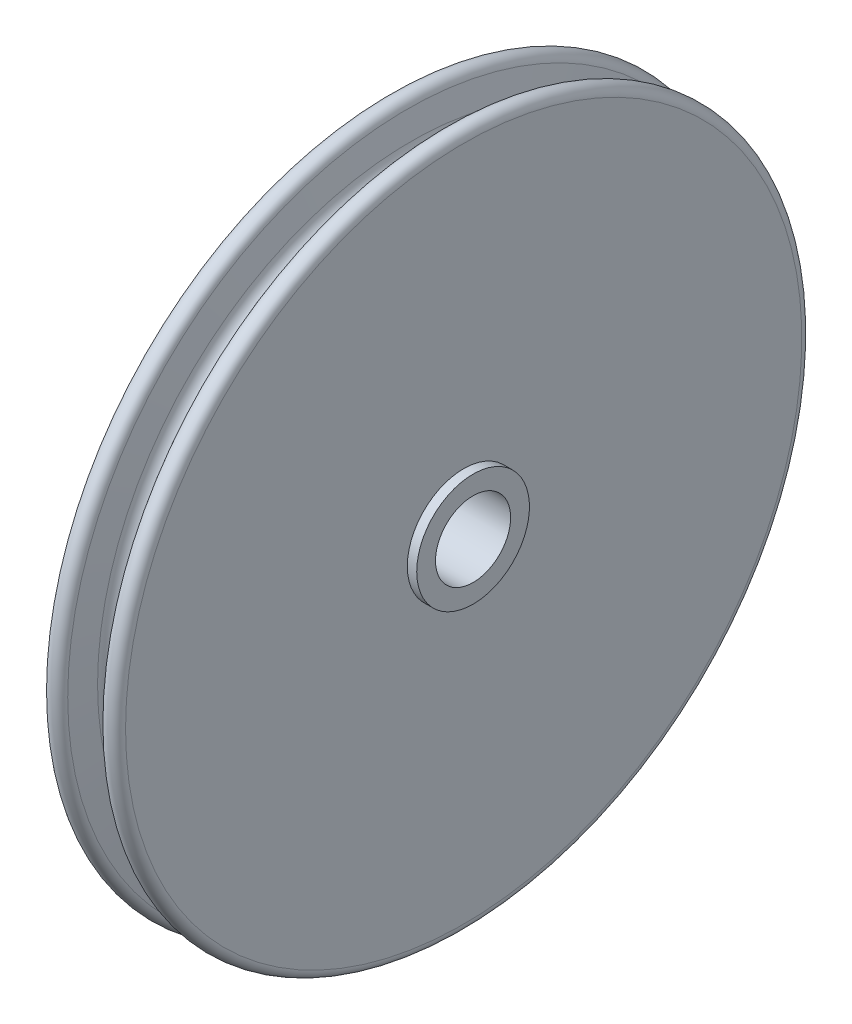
from build123d import *


with BuildPart() as part:
    # Esquisse1 → R_volution1 (revolve)
    with BuildSketch(Plane(origin=(0, 0, 0), x_dir=(1, 0, 0), z_dir=(0, 1, 0)), mode=Mode.PRIVATE) as r_volution1_sk:
        with BuildLine():
            Line((12.5, 10), (-12.5, 10))
            Line((-12.5, 10), (-12.5, 15))
            Line((-12.5, 15), (-10, 15))
            Line((-10, 15), (-10, 90))
            ThreePointArc((-10, 90), (-7.684093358, 92.493212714), (-5.027112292, 90.36718712))
            Line((-5.027112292, 90.36718712), (-4, 83.449914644))
            ThreePointArc((-4, 83.449914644), (0, 80), (4, 83.449914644))
            Line((4, 83.449914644), (5.027112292, 90.36718712))
            ThreePointArc((5.027112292, 90.36718712), (7.684093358, 92.493212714), (10, 90))
            Line((10, 90), (10, 15))
            Line((10, 15), (12.5, 15))
            Line((12.5, 15), (12.5, 10))
        make_face()
    revolve(r_volution1_sk.sketch.rotate(Axis((-12.5, 0, 0), (1, 0, 0)), 180), axis=Axis((-12.5, 0, 0), (1, 0, 0)))


solid = part.part
